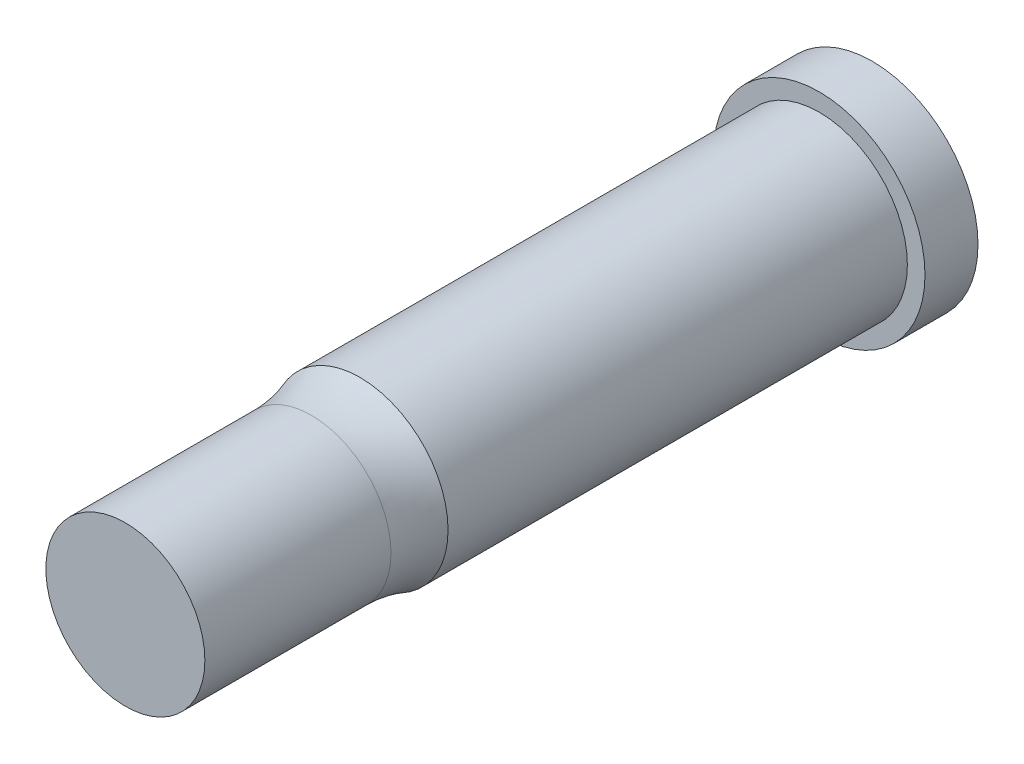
ISO-10303-21;
HEADER;
FILE_DESCRIPTION(('STEP AP214'),'2;1');
FILE_NAME('part.step','',(''),(''),'','','');
FILE_SCHEMA(('AUTOMOTIVE_DESIGN { 1 0 10303 214 1 1 1 1 }'));
ENDSEC;
DATA;
#1=APPLICATION_CONTEXT('core data for automotive mechanical design processes');
#2=APPLICATION_PROTOCOL_DEFINITION('international standard','automotive_design',2000,#1);
#3=PRODUCT_CONTEXT('',#1,'mechanical');
#4=PRODUCT('Part','Part','',(#3));
#5=PRODUCT_RELATED_PRODUCT_CATEGORY('part','',(#4));
#6=PRODUCT_DEFINITION_FORMATION('','',#4);
#7=PRODUCT_DEFINITION_CONTEXT('part definition',#1,'design');
#8=PRODUCT_DEFINITION('design','',#6,#7);
#9=PRODUCT_DEFINITION_SHAPE('','',#8);
#10=(LENGTH_UNIT() NAMED_UNIT(*) SI_UNIT(.MILLI.,.METRE.));
#11=(NAMED_UNIT(*) PLANE_ANGLE_UNIT() SI_UNIT($,.RADIAN.));
#12=(NAMED_UNIT(*) SI_UNIT($,.STERADIAN.) SOLID_ANGLE_UNIT());
#13=UNCERTAINTY_MEASURE_WITH_UNIT(LENGTH_MEASURE(1.E-05),#10,'distance_accuracy_value','');
#14=(GEOMETRIC_REPRESENTATION_CONTEXT(3) GLOBAL_UNCERTAINTY_ASSIGNED_CONTEXT((#13)) GLOBAL_UNIT_ASSIGNED_CONTEXT((#10,
#11,#12)) REPRESENTATION_CONTEXT('',''));
#15=CARTESIAN_POINT('',(0.,0.,0.));
#16=DIRECTION('',(0.,0.,1.));
#17=DIRECTION('',(1.,0.,0.));
#18=AXIS2_PLACEMENT_3D('',#15,#16,#17);
#19=CARTESIAN_POINT('',(0.,-1.11022302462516E-13,43.5171681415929));
#20=DIRECTION('',(0.,0.,1.));
#21=DIRECTION('',(1.,0.,0.));
#22=AXIS2_PLACEMENT_3D('',#19,#20,#21);
#23=CYLINDRICAL_SURFACE('',#22,9.525);
#24=CARTESIAN_POINT('',(0.,0.,0.));
#25=DIRECTION('',(0.,0.,1.));
#26=DIRECTION('',(1.,0.,0.));
#27=AXIS2_PLACEMENT_3D('',#24,#25,#26);
#28=CIRCLE('',#27,9.525);
#29=CARTESIAN_POINT('',(9.525,0.,0.));
#30=VERTEX_POINT('',#29);
#31=EDGE_CURVE('E10',#30,#30,#28,.T.);
#32=ORIENTED_EDGE('',*,*,#31,.F.);
#33=EDGE_LOOP('',(#32));
#34=FACE_BOUND('',#33,.T.);
#35=CARTESIAN_POINT('',(0.,-1.11022302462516E-13,-4.77520000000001));
#36=DIRECTION('',(0.,0.,1.));
#37=DIRECTION('',(1.,0.,0.));
#38=AXIS2_PLACEMENT_3D('',#35,#36,#37);
#39=CIRCLE('',#38,9.525);
#40=CARTESIAN_POINT('',(9.525,-1.11022302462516E-13,-4.77520000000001));
#41=VERTEX_POINT('',#40);
#42=EDGE_CURVE('E68',#41,#41,#39,.T.);
#43=ORIENTED_EDGE('',*,*,#42,.T.);
#44=EDGE_LOOP('',(#43));
#45=FACE_BOUND('',#44,.T.);
#46=ADVANCED_FACE('F39',(#34,#45),#23,.T.);
#47=CARTESIAN_POINT('',(-7.93750000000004,0.,0.));
#48=DIRECTION('',(0.,0.,-1.));
#49=DIRECTION('',(-1.,0.,0.));
#50=AXIS2_PLACEMENT_3D('',#47,#48,#49);
#51=PLANE('',#50);
#52=CARTESIAN_POINT('',(0.,0.,0.));
#53=DIRECTION('',(0.,0.,1.));
#54=DIRECTION('',(1.,0.,0.));
#55=AXIS2_PLACEMENT_3D('',#52,#53,#54);
#56=CIRCLE('',#55,7.9375);
#57=CARTESIAN_POINT('',(7.9375,0.,0.));
#58=VERTEX_POINT('',#57);
#59=EDGE_CURVE('E46',#58,#58,#56,.T.);
#60=ORIENTED_EDGE('',*,*,#59,.F.);
#61=EDGE_LOOP('',(#60));
#62=FACE_BOUND('',#61,.T.);
#63=ORIENTED_EDGE('',*,*,#31,.T.);
#64=EDGE_LOOP('',(#63));
#65=FACE_BOUND('',#64,.T.);
#66=ADVANCED_FACE('F86',(#62,#65),#51,.F.);
#67=CARTESIAN_POINT('',(0.,-1.11022302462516E-13,43.5171681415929));
#68=DIRECTION('',(0.,0.,1.));
#69=DIRECTION('',(1.,0.,0.));
#70=AXIS2_PLACEMENT_3D('',#67,#68,#69);
#71=CYLINDRICAL_SURFACE('',#70,7.9375);
#72=CARTESIAN_POINT('',(0.,0.,41.3773366));
#73=DIRECTION('',(0.,0.,1.));
#74=DIRECTION('',(1.,0.,0.));
#75=AXIS2_PLACEMENT_3D('',#72,#73,#74);
#76=CIRCLE('',#75,7.93749999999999);
#77=CARTESIAN_POINT('',(7.93749999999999,0.,41.3773366));
#78=VERTEX_POINT('',#77);
#79=EDGE_CURVE('E52',#78,#78,#76,.T.);
#80=ORIENTED_EDGE('',*,*,#79,.F.);
#81=EDGE_LOOP('',(#80));
#82=FACE_BOUND('',#81,.T.);
#83=ORIENTED_EDGE('',*,*,#59,.T.);
#84=EDGE_LOOP('',(#83));
#85=FACE_BOUND('',#84,.T.);
#86=ADVANCED_FACE('F91',(#82,#85),#71,.T.);
#87=CARTESIAN_POINT('',(0.,-1.11022302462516E-13,45.7450842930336));
#88=DIRECTION('',(0.,0.,1.));
#89=DIRECTION('',(1.,0.,0.));
#90=AXIS2_PLACEMENT_3D('',#87,#88,#89);
#91=TOROIDAL_SURFACE('',#90,19.8628,12.7);
#92=CARTESIAN_POINT('',(0.,-1.11022302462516E-13,45.7450842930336));
#93=DIRECTION('',(0.,0.,1.));
#94=DIRECTION('',(1.,0.,0.));
#95=AXIS2_PLACEMENT_3D('',#92,#93,#94);
#96=CIRCLE('',#95,7.16279999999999);
#97=CARTESIAN_POINT('',(7.16279999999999,-1.11022302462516E-13,45.7450842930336));
#98=VERTEX_POINT('',#97);
#99=EDGE_CURVE('E58',#98,#98,#96,.T.);
#100=ORIENTED_EDGE('',*,*,#99,.F.);
#101=EDGE_LOOP('',(#100));
#102=FACE_BOUND('',#101,.T.);
#103=ORIENTED_EDGE('',*,*,#79,.T.);
#104=EDGE_LOOP('',(#103));
#105=FACE_BOUND('',#104,.T.);
#106=ADVANCED_FACE('F96',(#102,#105),#91,.F.);
#107=CARTESIAN_POINT('',(0.,-1.11022302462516E-13,43.5171681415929));
#108=DIRECTION('',(0.,0.,1.));
#109=DIRECTION('',(1.,0.,0.));
#110=AXIS2_PLACEMENT_3D('',#107,#108,#109);
#111=CYLINDRICAL_SURFACE('',#110,7.16279999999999);
#112=CARTESIAN_POINT('',(0.,0.,62.5101366));
#113=DIRECTION('',(0.,0.,1.));
#114=DIRECTION('',(1.,0.,0.));
#115=AXIS2_PLACEMENT_3D('',#112,#113,#114);
#116=CIRCLE('',#115,7.16279999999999);
#117=CARTESIAN_POINT('',(7.16279999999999,0.,62.5101366));
#118=VERTEX_POINT('',#117);
#119=EDGE_CURVE('E64',#118,#118,#116,.T.);
#120=ORIENTED_EDGE('',*,*,#119,.F.);
#121=EDGE_LOOP('',(#120));
#122=FACE_BOUND('',#121,.T.);
#123=ORIENTED_EDGE('',*,*,#99,.T.);
#124=EDGE_LOOP('',(#123));
#125=FACE_BOUND('',#124,.T.);
#126=ADVANCED_FACE('F82',(#122,#125),#111,.T.);
#127=CARTESIAN_POINT('',(0.,0.,62.5101366));
#128=DIRECTION('',(0.,0.,-1.));
#129=DIRECTION('',(-1.,0.,0.));
#130=AXIS2_PLACEMENT_3D('',#127,#128,#129);
#131=PLANE('',#130);
#132=ORIENTED_EDGE('',*,*,#119,.T.);
#133=EDGE_LOOP('',(#132));
#134=FACE_BOUND('',#133,.T.);
#135=ADVANCED_FACE('F77',(#134),#131,.F.);
#136=CARTESIAN_POINT('',(-9.52500000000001,-1.11022302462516E-13,-4.77519999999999));
#137=DIRECTION('',(0.,0.,1.));
#138=DIRECTION('',(1.,0.,0.));
#139=AXIS2_PLACEMENT_3D('',#136,#137,#138);
#140=PLANE('',#139);
#141=ORIENTED_EDGE('',*,*,#42,.F.);
#142=EDGE_LOOP('',(#141));
#143=FACE_BOUND('',#142,.T.);
#144=ADVANCED_FACE('F75',(#143),#140,.F.);
#145=CLOSED_SHELL('',(#46,#66,#86,#106,#126,#135,#144));
#146=MANIFOLD_SOLID_BREP('B2',#145);
#147=ADVANCED_BREP_SHAPE_REPRESENTATION('',(#18,#146),#14);
#148=SHAPE_DEFINITION_REPRESENTATION(#9,#147);
ENDSEC;
END-ISO-10303-21;
